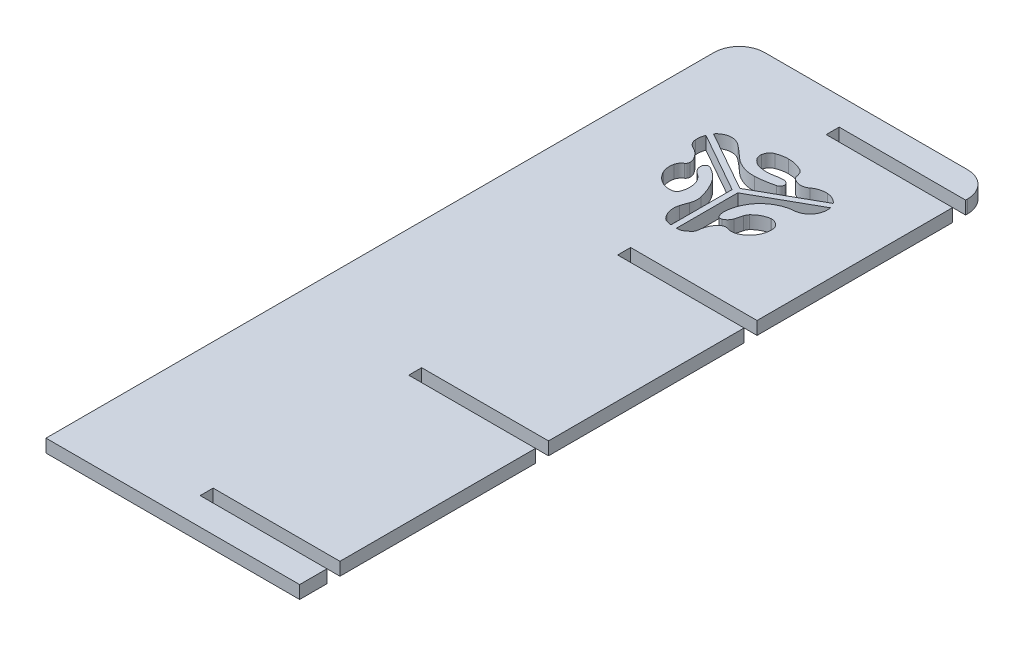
from build123d import *

# Parameters (mm, degrees)
SALIENTE_EXTRUIR1_DEPTH = 23


with BuildPart() as part:
    # Croquis1 → Saliente-Extruir1 (new body)
    with BuildSketch(Plane(origin=(0, 0, 0), x_dir=(1, 0, 0), z_dir=(0, 1, 0))):
        with BuildLine():
            Line((-56.986045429, -430.770626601), (393.013954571, -430.770626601))
            Line((393.013954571, -430.770626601), (393.013954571, -382.270626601))
            Line((393.013954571, -382.270626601), (168.013954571, -382.270626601))
            Line((168.013954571, -382.270626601), (168.013954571, -359.270626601))
            Line((168.013954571, -359.270626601), (393.013954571, -359.270626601))
            Line((393.013954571, -359.270626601), (393.013954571, -12.270626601))
            Line((393.013954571, -12.270626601), (168.013954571, -12.270626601))
            Line((168.013954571, -12.270626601), (168.013954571, 10.729373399))
            Line((168.013954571, 10.729373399), (393.013954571, 10.729373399))
            Line((393.013954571, 10.729373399), (393.013954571, 357.729373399))
            Line((393.013954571, 357.729373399), (168.716438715, 357.729373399))
            Line((168.716438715, 357.729373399), (168.716438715, 380.729373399))
            Line((168.716438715, 380.729373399), (393.013954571, 380.729373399))
            Line((393.013954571, 380.729373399), (393.013954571, 727.729373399))
            Line((393.013954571, 727.729373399), (168.716438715, 727.729373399))
            Line((168.716438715, 727.729373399), (168.716438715, 750.729373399))
            Line((168.716438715, 750.729373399), (393.013954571, 750.729373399))
            Line((393.013954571, 750.729373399), (393.013954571, 754.229373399))
            ThreePointArc((393.013954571, 754.229373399), (379.833759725, 786.049178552), (348.013954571, 799.229373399))
            Line((348.013954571, 799.229373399), (-11.986045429, 799.229373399))
            ThreePointArc((-11.986045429, 799.229373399), (-43.805850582, 786.049178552), (-56.986045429, 754.229373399))
            Line((-56.986045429, 754.229373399), (-56.986045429, -430.770626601))
        make_face()
        with BuildLine():
            Line((63.05181969, 620.023058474), (169.757233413, 559.780816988))
            Line((169.757233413, 559.780816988), (169.706555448, 451.336304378))
            ThreePointArc((169.706555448, 451.336304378), (165.593917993, 451.981523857), (161.535506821, 452.908558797))
            ThreePointArc((161.535506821, 452.908558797), (157.524986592, 454.671082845), (154.243428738, 457.573175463))
            ThreePointArc((154.243428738, 457.573175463), (152.095661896, 460.447016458), (150.244687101, 463.520411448))
            ThreePointArc((150.244687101, 463.520411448), (146.462724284, 475.874052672), (147.664890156, 488.737586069))
            ThreePointArc((147.664890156, 488.737586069), (149.726819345, 495.118050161), (152.095674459, 501.391039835))
            ThreePointArc((152.095674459, 501.391039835), (154.311033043, 510.829079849), (153.546059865, 520.493407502))
            ThreePointArc((153.546059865, 520.493407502), (148.935530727, 535.327932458), (142.368340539, 549.406004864))
            ThreePointArc((142.368340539, 549.406004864), (131.111859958, 563.957472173), (115.966177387, 574.400740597))
            ThreePointArc((115.966177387, 574.400740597), (110.336344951, 574.459926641), (106.693214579, 570.167361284))
            ThreePointArc((106.693214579, 570.167361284), (106.444002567, 564.274397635), (108.757854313, 558.848974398))
            ThreePointArc((108.757854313, 558.848974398), (111.605615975, 555.585670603), (115.000666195, 552.896333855))
            ThreePointArc((115.000666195, 552.896333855), (123.391802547, 544.641577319), (127.928565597, 533.780179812))
            ThreePointArc((127.928565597, 533.780179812), (128.658448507, 523.067033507), (126.637453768, 512.520953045))
            ThreePointArc((126.637453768, 512.520953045), (123.408574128, 507.623417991), (118.147559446, 505.028569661))
            ThreePointArc((118.147559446, 505.028569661), (116.021997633, 504.722143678), (113.876430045, 504.630221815))
            ThreePointArc((113.876430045, 504.630221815), (99.406869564, 507.911316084), (87.633590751, 516.940361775))
            ThreePointArc((87.633590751, 516.940361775), (84.640374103, 520.851686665), (82.03362738, 525.030523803))
            ThreePointArc((82.03362738, 525.030523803), (81.717196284, 525.623384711), (81.424398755, 526.228266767))
            ThreePointArc((81.424398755, 526.228266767), (78.644207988, 536.44161506), (79.33016702, 547.004351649))
            ThreePointArc((79.33016702, 547.004351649), (82.070376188, 553.102269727), (86.897044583, 557.727918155))
            ThreePointArc((86.897044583, 557.727918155), (89.517508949, 560.545753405), (90.46842493, 564.274397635))
            ThreePointArc((90.46842493, 564.274397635), (89.843209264, 569.060269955), (88.009526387, 573.524917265))
            ThreePointArc((88.009526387, 573.524917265), (80.304820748, 583.162340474), (70.030105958, 589.994078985))
            ThreePointArc((70.030105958, 589.994078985), (63.55353859, 595.452932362), (60.778744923, 603.455777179))
            ThreePointArc((60.778744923, 603.455777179), (61.076809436, 611.85445852), (63.05181969, 620.023058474))
        make_face(mode=Mode.SUBTRACT)
        with BuildLine():
            Line((179.757233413, 559.777774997), (285.062655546, 619.090016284))
            ThreePointArc((285.062655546, 619.090016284), (278.458301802, 593.227986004), (254.209883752, 582.071090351))
            ThreePointArc((254.209883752, 582.071090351), (214.705199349, 561.64230054), (196.652379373, 520.996867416))
            ThreePointArc((196.652379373, 520.996867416), (196.881166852, 514.628138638), (198.569482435, 508.483007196))
            ThreePointArc((198.569482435, 508.483007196), (201.678087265, 505.321317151), (206.111855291, 505.283780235))
            ThreePointArc((206.111855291, 505.283780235), (212.430325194, 509.607668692), (216.359336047, 516.178965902))
            ThreePointArc((216.359336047, 516.178965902), (218.437166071, 522.922051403), (220.188069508, 529.757321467))
            ThreePointArc((220.188069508, 529.757321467), (221.556720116, 533.39850193), (223.833462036, 536.552522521))
            ThreePointArc((223.833462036, 536.552522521), (235.270037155, 545.215369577), (248.891615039, 549.720121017))
            ThreePointArc((248.891615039, 549.720121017), (249.072753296, 549.741266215), (249.254984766, 549.748328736))
            ThreePointArc((249.254984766, 549.748328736), (258.918579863, 547.004351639), (265.698102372, 539.59135258))
            ThreePointArc((265.698102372, 539.59135258), (266.382886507, 537.820280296), (266.720188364, 535.951630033))
            ThreePointArc((266.720188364, 535.951630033), (260.768862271, 511.751960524), (241.4001449, 496.070918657))
            ThreePointArc((241.4001449, 496.070918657), (233.560461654, 494.636852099), (225.704621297, 495.97959279))
            ThreePointArc((225.704621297, 495.97959279), (219.765299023, 496.473890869), (214.372307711, 493.937057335))
            ThreePointArc((214.372307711, 493.937057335), (208.596826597, 487.608184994), (204.643129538, 480.00692939))
            ThreePointArc((204.643129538, 480.00692939), (202.693821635, 473.265425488), (201.678087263, 466.32165419))
            ThreePointArc((201.678087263, 466.32165419), (200.983240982, 463.520372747), (199.413300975, 461.098539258))
            ThreePointArc((199.413300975, 461.098539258), (195.193545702, 457.084837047), (190.4598826, 453.692408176))
            ThreePointArc((190.4598826, 453.692408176), (186.93468299, 452.033664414), (183.127865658, 451.205048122))
            ThreePointArc((183.127865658, 451.205048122), (181.442524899, 451.057075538), (179.753700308, 450.956373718))
            Line((179.753700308, 450.956373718), (179.757233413, 559.777774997))
        make_face(mode=Mode.SUBTRACT)
        with BuildLine():
            Line((67.614977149, 628.903503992), (174.759837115, 568.440146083))
            Line((174.759837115, 568.440146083), (280.747245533, 628.162297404))
            ThreePointArc((280.747245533, 628.162297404), (271.434715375, 635.456835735), (259.982325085, 638.419311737))
            ThreePointArc((259.982325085, 638.419311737), (247.441541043, 636.855257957), (236.157630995, 631.163957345))
            ThreePointArc((236.157630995, 631.163957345), (222.571976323, 627.052516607), (209.474849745, 632.524192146))
            ThreePointArc((209.474849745, 632.524192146), (207.622784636, 634.853611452), (206.589263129, 637.644341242))
            ThreePointArc((206.589263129, 637.644341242), (205.764771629, 640.999018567), (204.643129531, 644.26636691))
            ThreePointArc((204.643129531, 644.26636691), (202.548083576, 647.691019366), (199.413300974, 650.19912623))
            ThreePointArc((199.413300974, 650.19912623), (186.643845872, 655.2399518), (173.023120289, 656.955976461))
            ThreePointArc((173.023120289, 656.955976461), (162.575235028, 655.982217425), (152.487246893, 653.094483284))
            ThreePointArc((152.487246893, 653.094483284), (145.409761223, 647.8107423), (142.048731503, 639.642988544))
            ThreePointArc((142.048731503, 639.642988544), (142.590912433, 633.282250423), (145.633181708, 627.669982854))
            ThreePointArc((145.633181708, 627.669982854), (152.487246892, 621.864812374), (160.855708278, 618.601827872))
            ThreePointArc((160.855708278, 618.601827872), (173.02312029, 617.342243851), (185.190532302, 618.601827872))
            ThreePointArc((185.190532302, 618.601827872), (192.268407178, 619.83592477), (199.413300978, 620.590776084))
            ThreePointArc((199.413300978, 620.590776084), (203.900073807, 619.96523659), (207.74133957, 617.563756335))
            ThreePointArc((207.74133957, 617.563756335), (209.023574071, 615.695438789), (209.474849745, 613.47483391))
            ThreePointArc((209.474849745, 613.47483391), (207.74133957, 608.37830322), (203.25983663, 605.395718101))
            ThreePointArc((203.25983663, 605.395718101), (186.523627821, 601.870260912), (169.512768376, 600.092567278))
            ThreePointArc((169.512768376, 600.092567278), (146.445283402, 603.594727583), (126.637453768, 615.924523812))
            ThreePointArc((126.637453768, 615.924523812), (116.347737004, 625.223179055), (105.606403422, 633.99626365))
            ThreePointArc((105.606403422, 633.99626365), (85.544367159, 639.404536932), (67.614977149, 628.903503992))
        make_face(mode=Mode.SUBTRACT)
    extrude(amount=SALIENTE_EXTRUIR1_DEPTH)


solid = part.part
